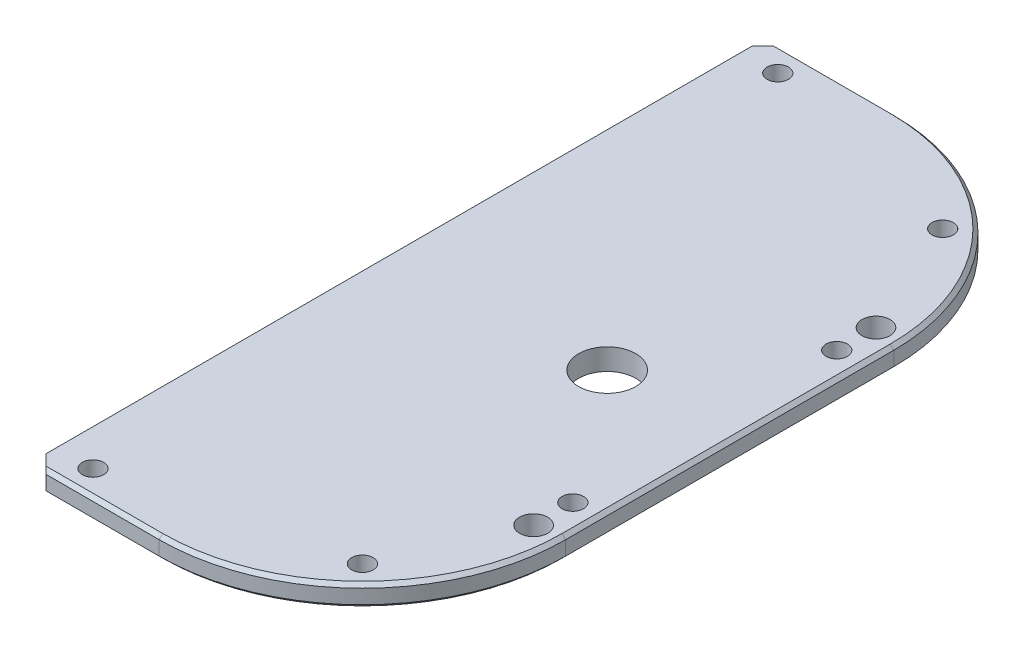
from build123d import *

# Parameters (mm, degrees)
SKETCH1_W             = 254
SKETCH1_H             = 330.2
BOSS_EXTRUDE1_DEPTH   = 4.7625
SKETCH3_OUTSIDE_W     = 339.34
SKETCH3_OUTSIDE_H     = 415.54
CUT_EXTRUDE1_DEPTH    = 209.513154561
SKETCH4_R             = 12.7
CUT_EXTRUDE2_DEPTH    = 199.431149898
HOLE1_D               = 9.525
HOLE1_DEPTH           = 88.9
MOVE_FACE1_BY         = 1.5875
MOVE_FACE1_2_BY       = 1.5875
MOVE_FACE1_3_BY       = 1.5875
MOVE_FACE1_4_BY       = 1.5875
MOVE_FACE1_5_BY       = 1.5875
CHAMFER2_SIZE         = 1.5875
M12_CLEARANCE_HOLE1_D = 12.5
CHAMFER3_SIZE         = 6.35


with BuildPart() as part:
    # Sketch1 → Boss-Extrude1 (new, symmetric)
    with BuildSketch(Plane(origin=(0, 0, 0), x_dir=(1, 0, 0), z_dir=(0, 1, 0))):
        Rectangle(SKETCH1_W, SKETCH1_H)
    extrude(amount=BOSS_EXTRUDE1_DEPTH, both=True)

    # Sketch3 outside → Cut-Extrude1 (cut, through all)
    with BuildSketch(Plane(origin=(0, 4.7625, 0), x_dir=(1, 0, 0), z_dir=(0, 1, 0))):
        Rectangle(SKETCH3_OUTSIDE_W, SKETCH3_OUTSIDE_H)
        with BuildLine():
            Line((-114.3, -161.925), (-114.3, 161.925))
            Line((-114.3, 161.925), (-57.590886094, 161.925))
            ThreePointArc((-57.590886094, 161.925), (5.270906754, 135.886792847), (31.309113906, 73.025))
            Line((31.309113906, 73.025), (31.309113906, -73.025))
            ThreePointArc((31.309113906, -73.025), (5.270906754, -135.886792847), (-57.590886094, -161.925))
            Line((-57.590886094, -161.925), (-114.3, -161.925))
        make_face(mode=Mode.SUBTRACT)
    extrude(amount=-CUT_EXTRUDE1_DEPTH, mode=Mode.SUBTRACT)

    # Sketch4 → Cut-Extrude2 (cut, through all)
    with BuildSketch(Plane(origin=(0, 4.7625, 0), x_dir=(1, 0, 0), z_dir=(0, 1, 0))):
        with Locations(Location((-21.646272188, 0, 0), (0, 0, 270))):
            Circle(SKETCH4_R)
    extrude(amount=-CUT_EXTRUDE2_DEPTH, mode=Mode.SUBTRACT)

    # Hole1
    with Locations(Plane(origin=(0, 4.7625, 0), x_dir=(1, 0, 0), z_dir=(0, 1, 0))):
        with Locations((-98.135636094, -152.4), (-1.464285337, -129.151600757), (21.784113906, -58.7375), (21.784113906, 58.7375), (-1.464285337, 129.151600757), (-98.135636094, 152.4)):
            Hole(HOLE1_D / 2, depth=HOLE1_DEPTH)

    # Move Face1: a face moved outward by 1.5875
    extrude(part.faces().sort_by_distance((-85.945443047, 0, 161.925))[0], amount=MOVE_FACE1_BY, dir=(0, 0, 1))

    # Move Face1 2: a curved face moved outward by 1.5875
    add(Solid.thicken(part.faces().sort_by_distance((5.270906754, 0, 135.886792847))[0], MOVE_FACE1_2_BY))

    # Move Face1 3: a face moved outward by 1.5875
    extrude(part.faces().sort_by_distance((31.309113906, 0, 0))[0], amount=MOVE_FACE1_3_BY, dir=(1, 0, 0))

    # Move Face1 4: a curved face moved outward by 1.5875
    add(Solid.thicken(part.faces().sort_by_distance((5.270906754, 0, -135.886792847))[0], MOVE_FACE1_4_BY))

    # Move Face1 5: a face moved outward by 1.5875
    extrude(part.faces().sort_by_distance((-85.945443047, 0, -161.925))[0], amount=MOVE_FACE1_5_BY, dir=(0, 0, -1))

    # Chamfer2
    chamfer2_edges = [part.edges().sort_by_distance(p)[0] for p in [
        (6.393438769, -4.7625, -137.009324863),
        (-85.945443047, -4.7625, -163.5125),
        (-85.945443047, -4.7625, 163.5125),
        (6.393438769, -4.7625, 137.009324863),
        (32.896613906, -4.7625, 0),
        (-85.945443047, 4.7625, -163.5125),
        (6.393438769, 4.7625, -137.009324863),
        (32.896613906, 4.7625, 0),
        (6.393438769, 4.7625, 137.009324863),
        (-85.945443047, 4.7625, 163.5125),
    ]]
    chamfer(chamfer2_edges, length=CHAMFER2_SIZE)

    # M12 Clearance Hole1 (through all)
    with Locations(Plane(origin=(0, 4.7625, 0), x_dir=(1, 0, 0), z_dir=(0, 1, 0))):
        with Locations((21.784113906, 76.2), (21.784113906, -76.2)):
            Hole(M12_CLEARANCE_HOLE1_D / 2)

    # Chamfer3
    chamfer3_edges = [part.edges().sort_by_distance(p)[0] for p in [
        (-114.3, 0, 163.5125),
        (-114.3, 0, -163.5125),
    ]]
    chamfer(chamfer3_edges, length=CHAMFER3_SIZE)


solid = part.part
